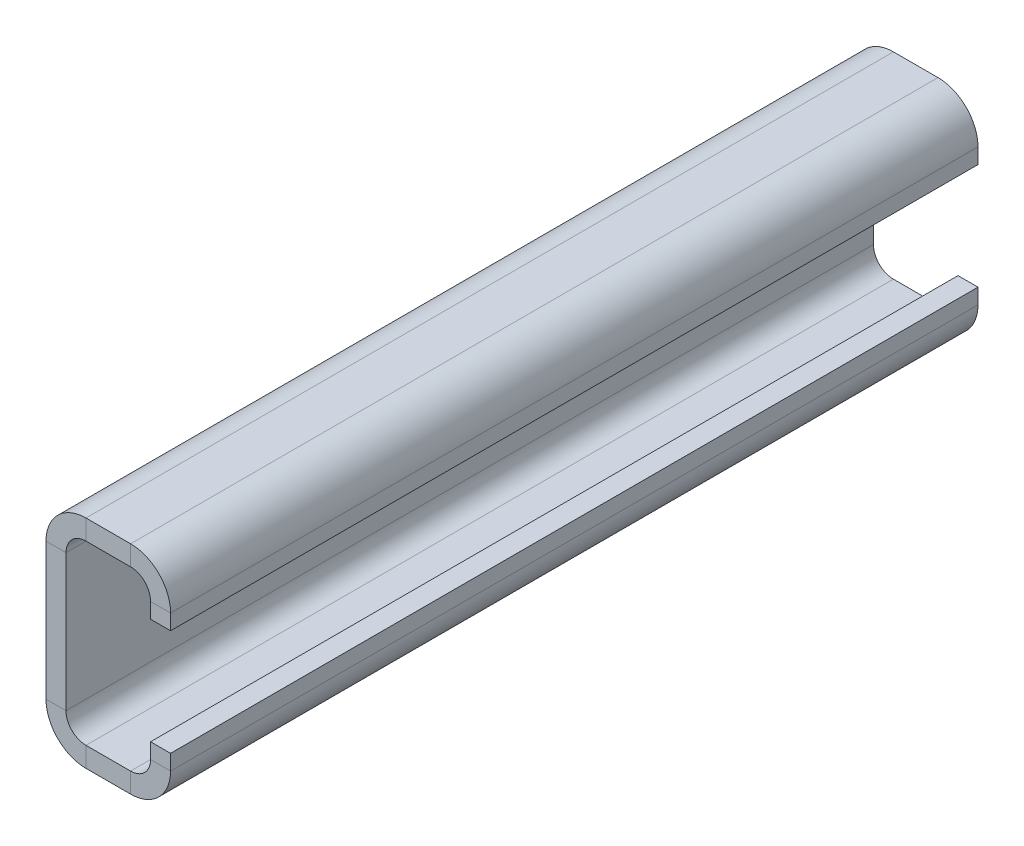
ISO-10303-21;
HEADER;
FILE_DESCRIPTION(('STEP AP214'),'2;1');
FILE_NAME('part.step','',(''),(''),'','','');
FILE_SCHEMA(('AUTOMOTIVE_DESIGN { 1 0 10303 214 1 1 1 1 }'));
ENDSEC;
DATA;
#1=APPLICATION_CONTEXT('core data for automotive mechanical design processes');
#2=APPLICATION_PROTOCOL_DEFINITION('international standard','automotive_design',2000,#1);
#3=PRODUCT_CONTEXT('',#1,'mechanical');
#4=PRODUCT('Part','Part','',(#3));
#5=PRODUCT_RELATED_PRODUCT_CATEGORY('part','',(#4));
#6=PRODUCT_DEFINITION_FORMATION('','',#4);
#7=PRODUCT_DEFINITION_CONTEXT('part definition',#1,'design');
#8=PRODUCT_DEFINITION('design','',#6,#7);
#9=PRODUCT_DEFINITION_SHAPE('','',#8);
#10=(LENGTH_UNIT() NAMED_UNIT(*) SI_UNIT(.MILLI.,.METRE.));
#11=(NAMED_UNIT(*) PLANE_ANGLE_UNIT() SI_UNIT($,.RADIAN.));
#12=(NAMED_UNIT(*) SI_UNIT($,.STERADIAN.) SOLID_ANGLE_UNIT());
#13=UNCERTAINTY_MEASURE_WITH_UNIT(LENGTH_MEASURE(1.E-05),#10,'distance_accuracy_value','');
#14=(GEOMETRIC_REPRESENTATION_CONTEXT(3) GLOBAL_UNCERTAINTY_ASSIGNED_CONTEXT((#13)) GLOBAL_UNIT_ASSIGNED_CONTEXT((#10,
#11,#12)) REPRESENTATION_CONTEXT('',''));
#15=CARTESIAN_POINT('',(0.,0.,0.));
#16=DIRECTION('',(0.,0.,1.));
#17=DIRECTION('',(1.,0.,0.));
#18=AXIS2_PLACEMENT_3D('',#15,#16,#17);
#19=CARTESIAN_POINT('',(11.,-14.100000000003,105.000000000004));
#20=DIRECTION('',(0.,0.,1.00000000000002));
#21=DIRECTION('',(1.,0.,0.));
#22=AXIS2_PLACEMENT_3D('',#19,#20,#21);
#23=PLANE('',#22);
#24=DIRECTION('',(0.,1.00000000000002,0.));
#25=VECTOR('',#24,1.);
#26=CARTESIAN_POINT('',(11.,-14.100000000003,105.000000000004));
#27=LINE('',#26,#25);
#28=CARTESIAN_POINT('',(11.,-14.100000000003,105.000000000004));
#29=VERTEX_POINT('',#28);
#30=CARTESIAN_POINT('',(11.,-11.5000000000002,105.000000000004));
#31=VERTEX_POINT('',#30);
#32=EDGE_CURVE('E11',#29,#31,#27,.T.);
#33=ORIENTED_EDGE('',*,*,#32,.F.);
#34=CARTESIAN_POINT('',(11.,-8.90000000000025,105.000000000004));
#35=DIRECTION('',(0.,0.,1.00000000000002));
#36=DIRECTION('',(1.,0.,0.));
#37=AXIS2_PLACEMENT_3D('',#34,#35,#36);
#38=CIRCLE('',#37,5.2);
#39=CARTESIAN_POINT('',(16.2,-8.90000000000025,105.000000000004));
#40=VERTEX_POINT('',#39);
#41=EDGE_CURVE('E311',#40,#29,#38,.F.);
#42=ORIENTED_EDGE('',*,*,#41,.F.);
#43=DIRECTION('',(1.,0.,0.));
#44=VECTOR('',#43,1.);
#45=CARTESIAN_POINT('',(13.6,-8.90000000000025,105.000000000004));
#46=LINE('',#45,#44);
#47=CARTESIAN_POINT('',(13.6,-8.90000000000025,105.000000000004));
#48=VERTEX_POINT('',#47);
#49=EDGE_CURVE('E48',#48,#40,#46,.T.);
#50=ORIENTED_EDGE('',*,*,#49,.F.);
#51=CARTESIAN_POINT('',(11.,-8.90000000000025,105.000000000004));
#52=DIRECTION('',(0.,0.,1.00000000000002));
#53=DIRECTION('',(1.,0.,0.));
#54=AXIS2_PLACEMENT_3D('',#51,#52,#53);
#55=CIRCLE('',#54,2.6);
#56=EDGE_CURVE('E326',#48,#31,#55,.F.);
#57=ORIENTED_EDGE('',*,*,#56,.T.);
#58=EDGE_LOOP('',(#33,#42,#50,#57));
#59=FACE_BOUND('',#58,.T.);
#60=ADVANCED_FACE('F40',(#59),#23,.T.);
#61=CARTESIAN_POINT('',(13.6,-8.90000000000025,105.000000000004));
#62=DIRECTION('',(0.,0.,1.00000000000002));
#63=DIRECTION('',(1.,0.,0.));
#64=AXIS2_PLACEMENT_3D('',#61,#62,#63);
#65=PLANE('',#64);
#66=DIRECTION('',(-1.,0.,0.));
#67=VECTOR('',#66,1.);
#68=CARTESIAN_POINT('',(16.2,-14.100000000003,105.000000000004));
#69=LINE('',#68,#67);
#70=CARTESIAN_POINT('',(5.19999999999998,-14.100000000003,105.000000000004));
#71=VERTEX_POINT('',#70);
#72=EDGE_CURVE('E307',#29,#71,#69,.T.);
#73=ORIENTED_EDGE('',*,*,#72,.F.);
#74=ORIENTED_EDGE('',*,*,#32,.T.);
#75=DIRECTION('',(-1.,0.,0.));
#76=VECTOR('',#75,1.);
#77=CARTESIAN_POINT('',(16.2,-11.5000000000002,105.000000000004));
#78=LINE('',#77,#76);
#79=CARTESIAN_POINT('',(5.19999999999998,-11.5000000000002,105.000000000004));
#80=VERTEX_POINT('',#79);
#81=EDGE_CURVE('E330',#31,#80,#78,.T.);
#82=ORIENTED_EDGE('',*,*,#81,.T.);
#83=DIRECTION('',(0.,-1.00000000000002,0.));
#84=VECTOR('',#83,1.);
#85=CARTESIAN_POINT('',(5.19999999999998,-11.5000000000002,105.000000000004));
#86=LINE('',#85,#84);
#87=EDGE_CURVE('E448',#80,#71,#86,.T.);
#88=ORIENTED_EDGE('',*,*,#87,.T.);
#89=EDGE_LOOP('',(#73,#74,#82,#88));
#90=FACE_BOUND('',#89,.T.);
#91=ADVANCED_FACE('F495',(#90),#65,.T.);
#92=CARTESIAN_POINT('',(16.2,-8.90000000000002,0.));
#93=DIRECTION('',(0.,0.,-1.00000000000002));
#94=DIRECTION('',(-1.,0.,0.));
#95=AXIS2_PLACEMENT_3D('',#92,#93,#94);
#96=PLANE('',#95);
#97=DIRECTION('',(-1.,0.,0.));
#98=VECTOR('',#97,1.);
#99=CARTESIAN_POINT('',(16.2,-8.90000000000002,0.));
#100=LINE('',#99,#98);
#101=CARTESIAN_POINT('',(16.2,-8.90000000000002,0.));
#102=VERTEX_POINT('',#101);
#103=CARTESIAN_POINT('',(13.6,-8.90000000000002,0.));
#104=VERTEX_POINT('',#103);
#105=EDGE_CURVE('E457',#102,#104,#100,.T.);
#106=ORIENTED_EDGE('',*,*,#105,.F.);
#107=CARTESIAN_POINT('',(11.,-8.90000000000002,0.));
#108=DIRECTION('',(0.,0.,1.00000000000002));
#109=DIRECTION('',(1.,0.,0.));
#110=AXIS2_PLACEMENT_3D('',#107,#108,#109);
#111=CIRCLE('',#110,5.2);
#112=CARTESIAN_POINT('',(11.,-14.100000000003,0.));
#113=VERTEX_POINT('',#112);
#114=EDGE_CURVE('E234',#102,#113,#111,.F.);
#115=ORIENTED_EDGE('',*,*,#114,.T.);
#116=DIRECTION('',(0.,-1.00000000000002,0.));
#117=VECTOR('',#116,1.);
#118=CARTESIAN_POINT('',(11.,-11.5,0.));
#119=LINE('',#118,#117);
#120=CARTESIAN_POINT('',(11.,-11.5,0.));
#121=VERTEX_POINT('',#120);
#122=EDGE_CURVE('E454',#121,#113,#119,.T.);
#123=ORIENTED_EDGE('',*,*,#122,.F.);
#124=CARTESIAN_POINT('',(11.,-8.90000000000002,0.));
#125=DIRECTION('',(0.,0.,1.00000000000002));
#126=DIRECTION('',(1.,0.,0.));
#127=AXIS2_PLACEMENT_3D('',#124,#125,#126);
#128=CIRCLE('',#127,2.6);
#129=EDGE_CURVE('E250',#104,#121,#128,.F.);
#130=ORIENTED_EDGE('',*,*,#129,.F.);
#131=EDGE_LOOP('',(#106,#115,#123,#130));
#132=FACE_BOUND('',#131,.T.);
#133=ADVANCED_FACE('F503',(#132),#96,.T.);
#134=CARTESIAN_POINT('',(11.,-11.5,0.));
#135=DIRECTION('',(0.,0.,-1.00000000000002));
#136=DIRECTION('',(-1.,0.,0.));
#137=AXIS2_PLACEMENT_3D('',#134,#135,#136);
#138=PLANE('',#137);
#139=DIRECTION('',(0.,-1.00000000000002,0.));
#140=VECTOR('',#139,1.);
#141=CARTESIAN_POINT('',(16.2,-6.90000000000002,0.));
#142=LINE('',#141,#140);
#143=CARTESIAN_POINT('',(16.2,-6.90000000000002,0.));
#144=VERTEX_POINT('',#143);
#145=EDGE_CURVE('E238',#144,#102,#142,.T.);
#146=ORIENTED_EDGE('',*,*,#145,.T.);
#147=ORIENTED_EDGE('',*,*,#105,.T.);
#148=DIRECTION('',(0.,1.00000000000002,0.));
#149=VECTOR('',#148,1.);
#150=CARTESIAN_POINT('',(13.6,-6.90000000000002,0.));
#151=LINE('',#150,#149);
#152=CARTESIAN_POINT('',(13.6,-6.90000000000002,0.));
#153=VERTEX_POINT('',#152);
#154=EDGE_CURVE('E246',#153,#104,#151,.F.);
#155=ORIENTED_EDGE('',*,*,#154,.F.);
#156=DIRECTION('',(1.,0.,0.));
#157=VECTOR('',#156,1.);
#158=CARTESIAN_POINT('',(13.6,-6.90000000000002,0.));
#159=LINE('',#158,#157);
#160=EDGE_CURVE('E242',#153,#144,#159,.T.);
#161=ORIENTED_EDGE('',*,*,#160,.T.);
#162=EDGE_LOOP('',(#146,#147,#155,#161));
#163=FACE_BOUND('',#162,.T.);
#164=ADVANCED_FACE('F505',(#163),#138,.T.);
#165=CARTESIAN_POINT('',(0.,-8.90000000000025,105.000000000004));
#166=DIRECTION('',(0.,0.,1.00000000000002));
#167=DIRECTION('',(1.,0.,0.));
#168=AXIS2_PLACEMENT_3D('',#165,#166,#167);
#169=PLANE('',#168);
#170=DIRECTION('',(1.,0.,0.));
#171=VECTOR('',#170,1.);
#172=CARTESIAN_POINT('',(0.,-8.90000000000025,105.000000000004));
#173=LINE('',#172,#171);
#174=CARTESIAN_POINT('',(0.,-8.90000000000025,105.000000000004));
#175=VERTEX_POINT('',#174);
#176=CARTESIAN_POINT('',(2.59999999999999,-8.90000000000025,105.000000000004));
#177=VERTEX_POINT('',#176);
#178=EDGE_CURVE('E451',#175,#177,#173,.T.);
#179=ORIENTED_EDGE('',*,*,#178,.F.);
#180=CARTESIAN_POINT('',(5.19999999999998,-8.90000000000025,105.000000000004));
#181=DIRECTION('',(0.,0.,1.00000000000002));
#182=DIRECTION('',(1.,0.,0.));
#183=AXIS2_PLACEMENT_3D('',#180,#181,#182);
#184=CIRCLE('',#183,5.2);
#185=EDGE_CURVE('E303',#71,#175,#184,.F.);
#186=ORIENTED_EDGE('',*,*,#185,.F.);
#187=ORIENTED_EDGE('',*,*,#87,.F.);
#188=CARTESIAN_POINT('',(5.19999999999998,-8.90000000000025,105.000000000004));
#189=DIRECTION('',(0.,0.,1.00000000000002));
#190=DIRECTION('',(1.,0.,0.));
#191=AXIS2_PLACEMENT_3D('',#188,#189,#190);
#192=CIRCLE('',#191,2.6);
#193=EDGE_CURVE('E334',#80,#177,#192,.F.);
#194=ORIENTED_EDGE('',*,*,#193,.T.);
#195=EDGE_LOOP('',(#179,#186,#187,#194));
#196=FACE_BOUND('',#195,.T.);
#197=ADVANCED_FACE('F507',(#196),#169,.T.);
#198=CARTESIAN_POINT('',(5.19999999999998,-11.5000000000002,105.000000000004));
#199=DIRECTION('',(0.,0.,1.00000000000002));
#200=DIRECTION('',(1.,0.,0.));
#201=AXIS2_PLACEMENT_3D('',#198,#199,#200);
#202=PLANE('',#201);
#203=DIRECTION('',(0.,1.00000000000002,0.));
#204=VECTOR('',#203,1.);
#205=CARTESIAN_POINT('',(0.,-14.100000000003,105.000000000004));
#206=LINE('',#205,#204);
#207=CARTESIAN_POINT('',(0.,8.89999999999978,105.000000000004));
#208=VERTEX_POINT('',#207);
#209=EDGE_CURVE('E299',#175,#208,#206,.T.);
#210=ORIENTED_EDGE('',*,*,#209,.F.);
#211=ORIENTED_EDGE('',*,*,#178,.T.);
#212=DIRECTION('',(0.,1.00000000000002,0.));
#213=VECTOR('',#212,1.);
#214=CARTESIAN_POINT('',(2.59999999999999,-14.100000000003,105.000000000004));
#215=LINE('',#214,#213);
#216=CARTESIAN_POINT('',(2.59999999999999,8.89999999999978,105.000000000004));
#217=VERTEX_POINT('',#216);
#218=EDGE_CURVE('E338',#177,#217,#215,.T.);
#219=ORIENTED_EDGE('',*,*,#218,.T.);
#220=DIRECTION('',(-1.,0.,0.));
#221=VECTOR('',#220,1.);
#222=CARTESIAN_POINT('',(2.59999999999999,8.89999999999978,105.000000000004));
#223=LINE('',#222,#221);
#224=EDGE_CURVE('E436',#217,#208,#223,.T.);
#225=ORIENTED_EDGE('',*,*,#224,.T.);
#226=EDGE_LOOP('',(#210,#211,#219,#225));
#227=FACE_BOUND('',#226,.T.);
#228=ADVANCED_FACE('F513',(#227),#202,.T.);
#229=CARTESIAN_POINT('',(5.19999999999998,-14.100000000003,0.));
#230=DIRECTION('',(0.,0.,-1.00000000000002));
#231=DIRECTION('',(-1.,0.,0.));
#232=AXIS2_PLACEMENT_3D('',#229,#230,#231);
#233=PLANE('',#232);
#234=DIRECTION('',(0.,1.00000000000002,0.));
#235=VECTOR('',#234,1.);
#236=CARTESIAN_POINT('',(5.19999999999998,-14.100000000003,0.));
#237=LINE('',#236,#235);
#238=CARTESIAN_POINT('',(5.19999999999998,-14.100000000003,0.));
#239=VERTEX_POINT('',#238);
#240=CARTESIAN_POINT('',(5.19999999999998,-11.5,0.));
#241=VERTEX_POINT('',#240);
#242=EDGE_CURVE('E445',#239,#241,#237,.T.);
#243=ORIENTED_EDGE('',*,*,#242,.F.);
#244=CARTESIAN_POINT('',(5.19999999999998,-8.90000000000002,0.));
#245=DIRECTION('',(0.,0.,1.00000000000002));
#246=DIRECTION('',(1.,0.,0.));
#247=AXIS2_PLACEMENT_3D('',#244,#245,#246);
#248=CIRCLE('',#247,5.2);
#249=CARTESIAN_POINT('',(0.,-8.90000000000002,0.));
#250=VERTEX_POINT('',#249);
#251=EDGE_CURVE('E226',#239,#250,#248,.F.);
#252=ORIENTED_EDGE('',*,*,#251,.T.);
#253=DIRECTION('',(-1.,0.,0.));
#254=VECTOR('',#253,1.);
#255=CARTESIAN_POINT('',(2.59999999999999,-8.90000000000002,0.));
#256=LINE('',#255,#254);
#257=CARTESIAN_POINT('',(2.59999999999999,-8.90000000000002,0.));
#258=VERTEX_POINT('',#257);
#259=EDGE_CURVE('E442',#258,#250,#256,.T.);
#260=ORIENTED_EDGE('',*,*,#259,.F.);
#261=CARTESIAN_POINT('',(5.19999999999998,-8.90000000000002,0.));
#262=DIRECTION('',(0.,0.,1.00000000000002));
#263=DIRECTION('',(1.,0.,0.));
#264=AXIS2_PLACEMENT_3D('',#261,#262,#263);
#265=CIRCLE('',#264,2.6);
#266=EDGE_CURVE('E258',#241,#258,#265,.F.);
#267=ORIENTED_EDGE('',*,*,#266,.F.);
#268=EDGE_LOOP('',(#243,#252,#260,#267));
#269=FACE_BOUND('',#268,.T.);
#270=ADVANCED_FACE('F543',(#269),#233,.T.);
#271=CARTESIAN_POINT('',(2.59999999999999,-8.90000000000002,0.));
#272=DIRECTION('',(0.,0.,-1.00000000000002));
#273=DIRECTION('',(-1.,0.,0.));
#274=AXIS2_PLACEMENT_3D('',#271,#272,#273);
#275=PLANE('',#274);
#276=DIRECTION('',(-1.,0.,0.));
#277=VECTOR('',#276,1.);
#278=CARTESIAN_POINT('',(16.2,-14.100000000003,0.));
#279=LINE('',#278,#277);
#280=EDGE_CURVE('E230',#113,#239,#279,.T.);
#281=ORIENTED_EDGE('',*,*,#280,.T.);
#282=ORIENTED_EDGE('',*,*,#242,.T.);
#283=DIRECTION('',(-1.,0.,0.));
#284=VECTOR('',#283,1.);
#285=CARTESIAN_POINT('',(16.2,-11.5,0.));
#286=LINE('',#285,#284);
#287=EDGE_CURVE('E254',#121,#241,#286,.T.);
#288=ORIENTED_EDGE('',*,*,#287,.F.);
#289=ORIENTED_EDGE('',*,*,#122,.T.);
#290=EDGE_LOOP('',(#281,#282,#288,#289));
#291=FACE_BOUND('',#290,.T.);
#292=ADVANCED_FACE('F552',(#291),#275,.T.);
#293=CARTESIAN_POINT('',(5.19999999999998,14.0999999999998,105.000000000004));
#294=DIRECTION('',(0.,0.,1.00000000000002));
#295=DIRECTION('',(1.,0.,0.));
#296=AXIS2_PLACEMENT_3D('',#293,#294,#295);
#297=PLANE('',#296);
#298=DIRECTION('',(0.,-1.00000000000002,0.));
#299=VECTOR('',#298,1.);
#300=CARTESIAN_POINT('',(5.19999999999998,14.0999999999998,105.000000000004));
#301=LINE('',#300,#299);
#302=CARTESIAN_POINT('',(5.19999999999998,14.0999999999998,105.000000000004));
#303=VERTEX_POINT('',#302);
#304=CARTESIAN_POINT('',(5.19999999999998,11.4999999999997,105.000000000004));
#305=VERTEX_POINT('',#304);
#306=EDGE_CURVE('E439',#303,#305,#301,.T.);
#307=ORIENTED_EDGE('',*,*,#306,.F.);
#308=CARTESIAN_POINT('',(5.19999999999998,8.89999999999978,105.000000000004));
#309=DIRECTION('',(0.,0.,1.00000000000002));
#310=DIRECTION('',(1.,0.,0.));
#311=AXIS2_PLACEMENT_3D('',#308,#309,#310);
#312=CIRCLE('',#311,5.2);
#313=EDGE_CURVE('E295',#208,#303,#312,.F.);
#314=ORIENTED_EDGE('',*,*,#313,.F.);
#315=ORIENTED_EDGE('',*,*,#224,.F.);
#316=CARTESIAN_POINT('',(5.19999999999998,8.89999999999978,105.000000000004));
#317=DIRECTION('',(0.,0.,1.00000000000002));
#318=DIRECTION('',(1.,0.,0.));
#319=AXIS2_PLACEMENT_3D('',#316,#317,#318);
#320=CIRCLE('',#319,2.6);
#321=EDGE_CURVE('E341',#217,#305,#320,.F.);
#322=ORIENTED_EDGE('',*,*,#321,.T.);
#323=EDGE_LOOP('',(#307,#314,#315,#322));
#324=FACE_BOUND('',#323,.T.);
#325=ADVANCED_FACE('F561',(#324),#297,.T.);
#326=CARTESIAN_POINT('',(2.59999999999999,8.89999999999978,105.000000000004));
#327=DIRECTION('',(0.,0.,1.00000000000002));
#328=DIRECTION('',(1.,0.,0.));
#329=AXIS2_PLACEMENT_3D('',#326,#327,#328);
#330=PLANE('',#329);
#331=DIRECTION('',(1.,0.,0.));
#332=VECTOR('',#331,1.);
#333=CARTESIAN_POINT('',(0.,14.0999999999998,105.000000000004));
#334=LINE('',#333,#332);
#335=CARTESIAN_POINT('',(11.,14.0999999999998,105.000000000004));
#336=VERTEX_POINT('',#335);
#337=EDGE_CURVE('E291',#303,#336,#334,.T.);
#338=ORIENTED_EDGE('',*,*,#337,.F.);
#339=ORIENTED_EDGE('',*,*,#306,.T.);
#340=DIRECTION('',(1.,0.,0.));
#341=VECTOR('',#340,1.);
#342=CARTESIAN_POINT('',(0.,11.4999999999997,105.000000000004));
#343=LINE('',#342,#341);
#344=CARTESIAN_POINT('',(11.,11.4999999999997,105.000000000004));
#345=VERTEX_POINT('',#344);
#346=EDGE_CURVE('E345',#305,#345,#343,.T.);
#347=ORIENTED_EDGE('',*,*,#346,.T.);
#348=DIRECTION('',(0.,1.00000000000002,0.));
#349=VECTOR('',#348,1.);
#350=CARTESIAN_POINT('',(11.,11.4999999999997,105.000000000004));
#351=LINE('',#350,#349);
#352=EDGE_CURVE('E62',#345,#336,#351,.T.);
#353=ORIENTED_EDGE('',*,*,#352,.T.);
#354=EDGE_LOOP('',(#338,#339,#347,#353));
#355=FACE_BOUND('',#354,.T.);
#356=ADVANCED_FACE('F569',(#355),#330,.T.);
#357=CARTESIAN_POINT('',(0.,8.90000000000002,0.));
#358=DIRECTION('',(0.,0.,-1.00000000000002));
#359=DIRECTION('',(-1.,0.,0.));
#360=AXIS2_PLACEMENT_3D('',#357,#358,#359);
#361=PLANE('',#360);
#362=DIRECTION('',(1.,0.,0.));
#363=VECTOR('',#362,1.);
#364=CARTESIAN_POINT('',(0.,8.90000000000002,0.));
#365=LINE('',#364,#363);
#366=CARTESIAN_POINT('',(0.,8.90000000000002,0.));
#367=VERTEX_POINT('',#366);
#368=CARTESIAN_POINT('',(2.59999999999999,8.90000000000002,0.));
#369=VERTEX_POINT('',#368);
#370=EDGE_CURVE('E433',#367,#369,#365,.T.);
#371=ORIENTED_EDGE('',*,*,#370,.F.);
#372=CARTESIAN_POINT('',(5.19999999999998,8.90000000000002,0.));
#373=DIRECTION('',(0.,0.,1.00000000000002));
#374=DIRECTION('',(1.,0.,0.));
#375=AXIS2_PLACEMENT_3D('',#372,#373,#374);
#376=CIRCLE('',#375,5.2);
#377=CARTESIAN_POINT('',(5.19999999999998,14.1,0.));
#378=VERTEX_POINT('',#377);
#379=EDGE_CURVE('E218',#367,#378,#376,.F.);
#380=ORIENTED_EDGE('',*,*,#379,.T.);
#381=DIRECTION('',(0.,1.00000000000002,0.));
#382=VECTOR('',#381,1.);
#383=CARTESIAN_POINT('',(5.19999999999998,11.5,0.));
#384=LINE('',#383,#382);
#385=CARTESIAN_POINT('',(5.19999999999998,11.5,0.));
#386=VERTEX_POINT('',#385);
#387=EDGE_CURVE('E430',#386,#378,#384,.T.);
#388=ORIENTED_EDGE('',*,*,#387,.F.);
#389=CARTESIAN_POINT('',(5.19999999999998,8.90000000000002,0.));
#390=DIRECTION('',(0.,0.,1.00000000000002));
#391=DIRECTION('',(1.,0.,0.));
#392=AXIS2_PLACEMENT_3D('',#389,#390,#391);
#393=CIRCLE('',#392,2.6);
#394=EDGE_CURVE('E266',#369,#386,#393,.F.);
#395=ORIENTED_EDGE('',*,*,#394,.F.);
#396=EDGE_LOOP('',(#371,#380,#388,#395));
#397=FACE_BOUND('',#396,.T.);
#398=ADVANCED_FACE('F578',(#397),#361,.T.);
#399=CARTESIAN_POINT('',(5.19999999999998,11.5,0.));
#400=DIRECTION('',(0.,0.,-1.00000000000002));
#401=DIRECTION('',(-1.,0.,0.));
#402=AXIS2_PLACEMENT_3D('',#399,#400,#401);
#403=PLANE('',#402);
#404=DIRECTION('',(0.,1.00000000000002,0.));
#405=VECTOR('',#404,1.);
#406=CARTESIAN_POINT('',(0.,-14.100000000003,0.));
#407=LINE('',#406,#405);
#408=EDGE_CURVE('E222',#250,#367,#407,.T.);
#409=ORIENTED_EDGE('',*,*,#408,.T.);
#410=ORIENTED_EDGE('',*,*,#370,.T.);
#411=DIRECTION('',(0.,1.00000000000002,0.));
#412=VECTOR('',#411,1.);
#413=CARTESIAN_POINT('',(2.59999999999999,-14.100000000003,0.));
#414=LINE('',#413,#412);
#415=EDGE_CURVE('E262',#258,#369,#414,.T.);
#416=ORIENTED_EDGE('',*,*,#415,.F.);
#417=ORIENTED_EDGE('',*,*,#259,.T.);
#418=EDGE_LOOP('',(#409,#410,#416,#417));
#419=FACE_BOUND('',#418,.T.);
#420=ADVANCED_FACE('F587',(#419),#403,.T.);
#421=CARTESIAN_POINT('',(16.2,8.89999999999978,105.000000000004));
#422=DIRECTION('',(0.,0.,1.00000000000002));
#423=DIRECTION('',(1.,0.,0.));
#424=AXIS2_PLACEMENT_3D('',#421,#422,#423);
#425=PLANE('',#424);
#426=DIRECTION('',(-1.,0.,0.));
#427=VECTOR('',#426,1.);
#428=CARTESIAN_POINT('',(16.2,8.89999999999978,105.000000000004));
#429=LINE('',#428,#427);
#430=CARTESIAN_POINT('',(16.2,8.89999999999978,105.000000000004));
#431=VERTEX_POINT('',#430);
#432=CARTESIAN_POINT('',(13.6,8.89999999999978,105.000000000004));
#433=VERTEX_POINT('',#432);
#434=EDGE_CURVE('E55',#431,#433,#429,.T.);
#435=ORIENTED_EDGE('',*,*,#434,.F.);
#436=CARTESIAN_POINT('',(11.,8.89999999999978,105.000000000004));
#437=DIRECTION('',(0.,0.,1.00000000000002));
#438=DIRECTION('',(1.,0.,0.));
#439=AXIS2_PLACEMENT_3D('',#436,#437,#438);
#440=CIRCLE('',#439,5.2);
#441=EDGE_CURVE('E287',#336,#431,#440,.F.);
#442=ORIENTED_EDGE('',*,*,#441,.F.);
#443=ORIENTED_EDGE('',*,*,#352,.F.);
#444=CARTESIAN_POINT('',(11.,8.89999999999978,105.000000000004));
#445=DIRECTION('',(0.,0.,1.00000000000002));
#446=DIRECTION('',(1.,0.,0.));
#447=AXIS2_PLACEMENT_3D('',#444,#445,#446);
#448=CIRCLE('',#447,2.6);
#449=EDGE_CURVE('E348',#345,#433,#448,.F.);
#450=ORIENTED_EDGE('',*,*,#449,.T.);
#451=EDGE_LOOP('',(#435,#442,#443,#450));
#452=FACE_BOUND('',#451,.T.);
#453=ADVANCED_FACE('F596',(#452),#425,.T.);
#454=CARTESIAN_POINT('',(11.,11.4999999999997,105.000000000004));
#455=DIRECTION('',(0.,0.,1.00000000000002));
#456=DIRECTION('',(1.,0.,0.));
#457=AXIS2_PLACEMENT_3D('',#454,#455,#456);
#458=PLANE('',#457);
#459=DIRECTION('',(0.,-1.00000000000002,0.));
#460=VECTOR('',#459,1.);
#461=CARTESIAN_POINT('',(16.2,14.0999999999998,105.000000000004));
#462=LINE('',#461,#460);
#463=CARTESIAN_POINT('',(16.2,6.89999999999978,105.000000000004));
#464=VERTEX_POINT('',#463);
#465=EDGE_CURVE('E283',#431,#464,#462,.T.);
#466=ORIENTED_EDGE('',*,*,#465,.F.);
#467=ORIENTED_EDGE('',*,*,#434,.T.);
#468=DIRECTION('',(0.,1.00000000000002,0.));
#469=VECTOR('',#468,1.);
#470=CARTESIAN_POINT('',(13.6,14.0999999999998,105.000000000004));
#471=LINE('',#470,#469);
#472=CARTESIAN_POINT('',(13.6,6.89999999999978,105.000000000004));
#473=VERTEX_POINT('',#472);
#474=EDGE_CURVE('E278',#433,#473,#471,.F.);
#475=ORIENTED_EDGE('',*,*,#474,.T.);
#476=DIRECTION('',(-1.,0.,0.));
#477=VECTOR('',#476,1.);
#478=CARTESIAN_POINT('',(16.2,6.89999999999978,105.000000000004));
#479=LINE('',#478,#477);
#480=EDGE_CURVE('E184',#464,#473,#479,.T.);
#481=ORIENTED_EDGE('',*,*,#480,.F.);
#482=EDGE_LOOP('',(#466,#467,#475,#481));
#483=FACE_BOUND('',#482,.T.);
#484=ADVANCED_FACE('F605',(#483),#458,.T.);
#485=CARTESIAN_POINT('',(11.,14.1,0.));
#486=DIRECTION('',(0.,0.,-1.00000000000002));
#487=DIRECTION('',(-1.,0.,0.));
#488=AXIS2_PLACEMENT_3D('',#485,#486,#487);
#489=PLANE('',#488);
#490=DIRECTION('',(0.,-1.00000000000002,0.));
#491=VECTOR('',#490,1.);
#492=CARTESIAN_POINT('',(11.,14.1,0.));
#493=LINE('',#492,#491);
#494=CARTESIAN_POINT('',(11.,14.1,0.));
#495=VERTEX_POINT('',#494);
#496=CARTESIAN_POINT('',(11.,11.5,0.));
#497=VERTEX_POINT('',#496);
#498=EDGE_CURVE('E423',#495,#497,#493,.T.);
#499=ORIENTED_EDGE('',*,*,#498,.F.);
#500=CARTESIAN_POINT('',(11.,8.90000000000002,0.));
#501=DIRECTION('',(0.,0.,1.00000000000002));
#502=DIRECTION('',(1.,0.,0.));
#503=AXIS2_PLACEMENT_3D('',#500,#501,#502);
#504=CIRCLE('',#503,5.2);
#505=CARTESIAN_POINT('',(16.2,8.90000000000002,0.));
#506=VERTEX_POINT('',#505);
#507=EDGE_CURVE('E208',#495,#506,#504,.F.);
#508=ORIENTED_EDGE('',*,*,#507,.T.);
#509=DIRECTION('',(1.,0.,0.));
#510=VECTOR('',#509,1.);
#511=CARTESIAN_POINT('',(13.6,8.90000000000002,0.));
#512=LINE('',#511,#510);
#513=CARTESIAN_POINT('',(13.6,8.90000000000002,0.));
#514=VERTEX_POINT('',#513);
#515=EDGE_CURVE('E188',#514,#506,#512,.T.);
#516=ORIENTED_EDGE('',*,*,#515,.F.);
#517=CARTESIAN_POINT('',(11.,8.90000000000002,0.));
#518=DIRECTION('',(0.,0.,1.00000000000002));
#519=DIRECTION('',(1.,0.,0.));
#520=AXIS2_PLACEMENT_3D('',#517,#518,#519);
#521=CIRCLE('',#520,2.6);
#522=EDGE_CURVE('E274',#497,#514,#521,.F.);
#523=ORIENTED_EDGE('',*,*,#522,.F.);
#524=EDGE_LOOP('',(#499,#508,#516,#523));
#525=FACE_BOUND('',#524,.T.);
#526=ADVANCED_FACE('F613',(#525),#489,.T.);
#527=CARTESIAN_POINT('',(13.6,8.90000000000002,0.));
#528=DIRECTION('',(0.,0.,-1.00000000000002));
#529=DIRECTION('',(-1.,0.,0.));
#530=AXIS2_PLACEMENT_3D('',#527,#528,#529);
#531=PLANE('',#530);
#532=DIRECTION('',(1.,0.,0.));
#533=VECTOR('',#532,1.);
#534=CARTESIAN_POINT('',(0.,14.1,0.));
#535=LINE('',#534,#533);
#536=EDGE_CURVE('E214',#378,#495,#535,.T.);
#537=ORIENTED_EDGE('',*,*,#536,.T.);
#538=ORIENTED_EDGE('',*,*,#498,.T.);
#539=DIRECTION('',(1.,0.,0.));
#540=VECTOR('',#539,1.);
#541=CARTESIAN_POINT('',(0.,11.5,0.));
#542=LINE('',#541,#540);
#543=EDGE_CURVE('E270',#386,#497,#542,.T.);
#544=ORIENTED_EDGE('',*,*,#543,.F.);
#545=ORIENTED_EDGE('',*,*,#387,.T.);
#546=EDGE_LOOP('',(#537,#538,#544,#545));
#547=FACE_BOUND('',#546,.T.);
#548=ADVANCED_FACE('F621',(#547),#531,.T.);
#549=CARTESIAN_POINT('',(13.6,14.0999999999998,105.000000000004));
#550=DIRECTION('',(1.,0.,0.));
#551=DIRECTION('',(0.,0.,-1.00000000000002));
#552=AXIS2_PLACEMENT_3D('',#549,#550,#551);
#553=PLANE('',#552);
#554=DIRECTION('',(0.,1.00000000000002,0.));
#555=VECTOR('',#554,1.);
#556=CARTESIAN_POINT('',(13.6,14.1,0.));
#557=LINE('',#556,#555);
#558=CARTESIAN_POINT('',(13.6,6.90000000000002,0.));
#559=VERTEX_POINT('',#558);
#560=EDGE_CURVE('E193',#514,#559,#557,.F.);
#561=ORIENTED_EDGE('',*,*,#560,.T.);
#562=DIRECTION('',(0.,0.,-1.00000000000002));
#563=VECTOR('',#562,1.);
#564=CARTESIAN_POINT('',(13.6,6.89999999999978,105.000000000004));
#565=LINE('',#564,#563);
#566=EDGE_CURVE('E177',#473,#559,#565,.T.);
#567=ORIENTED_EDGE('',*,*,#566,.F.);
#568=ORIENTED_EDGE('',*,*,#474,.F.);
#569=DIRECTION('',(0.,0.,-1.00000000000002));
#570=VECTOR('',#569,1.);
#571=CARTESIAN_POINT('',(13.6,8.89999999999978,105.000000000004));
#572=LINE('',#571,#570);
#573=EDGE_CURVE('E196',#433,#514,#572,.T.);
#574=ORIENTED_EDGE('',*,*,#573,.T.);
#575=EDGE_LOOP('',(#561,#567,#568,#574));
#576=FACE_BOUND('',#575,.T.);
#577=ADVANCED_FACE('F194',(#576),#553,.F.);
#578=CARTESIAN_POINT('',(16.2,6.89999999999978,105.000000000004));
#579=DIRECTION('',(0.,-1.00000000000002,0.));
#580=DIRECTION('',(0.,0.,-1.00000000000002));
#581=AXIS2_PLACEMENT_3D('',#578,#579,#580);
#582=PLANE('',#581);
#583=DIRECTION('',(-1.,0.,0.));
#584=VECTOR('',#583,1.);
#585=CARTESIAN_POINT('',(16.2,6.90000000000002,0.));
#586=LINE('',#585,#584);
#587=CARTESIAN_POINT('',(16.2,6.90000000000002,0.));
#588=VERTEX_POINT('',#587);
#589=EDGE_CURVE('E181',#588,#559,#586,.T.);
#590=ORIENTED_EDGE('',*,*,#589,.F.);
#591=DIRECTION('',(0.,0.,-1.00000000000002));
#592=VECTOR('',#591,1.);
#593=CARTESIAN_POINT('',(16.2,6.89999999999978,105.000000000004));
#594=LINE('',#593,#592);
#595=EDGE_CURVE('E189',#464,#588,#594,.T.);
#596=ORIENTED_EDGE('',*,*,#595,.F.);
#597=ORIENTED_EDGE('',*,*,#480,.T.);
#598=ORIENTED_EDGE('',*,*,#566,.T.);
#599=EDGE_LOOP('',(#590,#596,#597,#598));
#600=FACE_BOUND('',#599,.T.);
#601=ADVANCED_FACE('F179',(#600),#582,.T.);
#602=CARTESIAN_POINT('',(16.2,14.0999999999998,105.000000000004));
#603=DIRECTION('',(1.,0.,0.));
#604=DIRECTION('',(0.,0.,-1.00000000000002));
#605=AXIS2_PLACEMENT_3D('',#602,#603,#604);
#606=PLANE('',#605);
#607=DIRECTION('',(0.,-1.00000000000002,0.));
#608=VECTOR('',#607,1.);
#609=CARTESIAN_POINT('',(16.2,14.1,0.));
#610=LINE('',#609,#608);
#611=EDGE_CURVE('E202',#506,#588,#610,.T.);
#612=ORIENTED_EDGE('',*,*,#611,.F.);
#613=DIRECTION('',(0.,0.,-1.00000000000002));
#614=VECTOR('',#613,1.);
#615=CARTESIAN_POINT('',(16.2,8.89999999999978,105.000000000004));
#616=LINE('',#615,#614);
#617=EDGE_CURVE('E415',#431,#506,#616,.T.);
#618=ORIENTED_EDGE('',*,*,#617,.F.);
#619=ORIENTED_EDGE('',*,*,#465,.T.);
#620=ORIENTED_EDGE('',*,*,#595,.T.);
#621=EDGE_LOOP('',(#612,#618,#619,#620));
#622=FACE_BOUND('',#621,.T.);
#623=ADVANCED_FACE('F645',(#622),#606,.T.);
#624=CARTESIAN_POINT('',(11.,8.89999999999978,105.000000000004));
#625=DIRECTION('',(0.,0.,-1.00000000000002));
#626=DIRECTION('',(-1.,0.,0.));
#627=AXIS2_PLACEMENT_3D('',#624,#625,#626);
#628=CYLINDRICAL_SURFACE('',#627,5.2);
#629=ORIENTED_EDGE('',*,*,#507,.F.);
#630=DIRECTION('',(0.,0.,-1.00000000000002));
#631=VECTOR('',#630,1.);
#632=CARTESIAN_POINT('',(11.,14.0999999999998,105.000000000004));
#633=LINE('',#632,#631);
#634=EDGE_CURVE('E411',#336,#495,#633,.T.);
#635=ORIENTED_EDGE('',*,*,#634,.F.);
#636=ORIENTED_EDGE('',*,*,#441,.T.);
#637=ORIENTED_EDGE('',*,*,#617,.T.);
#638=EDGE_LOOP('',(#629,#635,#636,#637));
#639=FACE_BOUND('',#638,.T.);
#640=ADVANCED_FACE('F653',(#639),#628,.T.);
#641=CARTESIAN_POINT('',(0.,14.0999999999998,105.000000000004));
#642=DIRECTION('',(0.,1.00000000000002,0.));
#643=DIRECTION('',(-1.,0.,0.));
#644=AXIS2_PLACEMENT_3D('',#641,#642,#643);
#645=PLANE('',#644);
#646=ORIENTED_EDGE('',*,*,#536,.F.);
#647=DIRECTION('',(0.,0.,-1.00000000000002));
#648=VECTOR('',#647,1.);
#649=CARTESIAN_POINT('',(5.19999999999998,14.0999999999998,105.000000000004));
#650=LINE('',#649,#648);
#651=EDGE_CURVE('E407',#303,#378,#650,.T.);
#652=ORIENTED_EDGE('',*,*,#651,.F.);
#653=ORIENTED_EDGE('',*,*,#337,.T.);
#654=ORIENTED_EDGE('',*,*,#634,.T.);
#655=EDGE_LOOP('',(#646,#652,#653,#654));
#656=FACE_BOUND('',#655,.T.);
#657=ADVANCED_FACE('F662',(#656),#645,.T.);
#658=CARTESIAN_POINT('',(5.19999999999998,8.89999999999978,105.000000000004));
#659=DIRECTION('',(0.,0.,-1.00000000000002));
#660=DIRECTION('',(-1.,0.,0.));
#661=AXIS2_PLACEMENT_3D('',#658,#659,#660);
#662=CYLINDRICAL_SURFACE('',#661,5.2);
#663=ORIENTED_EDGE('',*,*,#379,.F.);
#664=DIRECTION('',(0.,0.,-1.00000000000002));
#665=VECTOR('',#664,1.);
#666=CARTESIAN_POINT('',(0.,8.89999999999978,105.000000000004));
#667=LINE('',#666,#665);
#668=EDGE_CURVE('E403',#208,#367,#667,.T.);
#669=ORIENTED_EDGE('',*,*,#668,.F.);
#670=ORIENTED_EDGE('',*,*,#313,.T.);
#671=ORIENTED_EDGE('',*,*,#651,.T.);
#672=EDGE_LOOP('',(#663,#669,#670,#671));
#673=FACE_BOUND('',#672,.T.);
#674=ADVANCED_FACE('F671',(#673),#662,.T.);
#675=CARTESIAN_POINT('',(0.,-14.100000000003,105.000000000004));
#676=DIRECTION('',(-1.,0.,0.));
#677=DIRECTION('',(0.,0.,1.00000000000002));
#678=AXIS2_PLACEMENT_3D('',#675,#676,#677);
#679=PLANE('',#678);
#680=ORIENTED_EDGE('',*,*,#408,.F.);
#681=DIRECTION('',(0.,0.,-1.00000000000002));
#682=VECTOR('',#681,1.);
#683=CARTESIAN_POINT('',(0.,-8.90000000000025,105.000000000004));
#684=LINE('',#683,#682);
#685=EDGE_CURVE('E399',#175,#250,#684,.T.);
#686=ORIENTED_EDGE('',*,*,#685,.F.);
#687=ORIENTED_EDGE('',*,*,#209,.T.);
#688=ORIENTED_EDGE('',*,*,#668,.T.);
#689=EDGE_LOOP('',(#680,#686,#687,#688));
#690=FACE_BOUND('',#689,.T.);
#691=ADVANCED_FACE('F680',(#690),#679,.T.);
#692=CARTESIAN_POINT('',(5.19999999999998,-8.90000000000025,105.000000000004));
#693=DIRECTION('',(0.,0.,-1.00000000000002));
#694=DIRECTION('',(-1.,0.,0.));
#695=AXIS2_PLACEMENT_3D('',#692,#693,#694);
#696=CYLINDRICAL_SURFACE('',#695,5.2);
#697=ORIENTED_EDGE('',*,*,#251,.F.);
#698=DIRECTION('',(0.,0.,-1.00000000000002));
#699=VECTOR('',#698,1.);
#700=CARTESIAN_POINT('',(5.19999999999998,-14.100000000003,105.000000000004));
#701=LINE('',#700,#699);
#702=EDGE_CURVE('E395',#71,#239,#701,.T.);
#703=ORIENTED_EDGE('',*,*,#702,.F.);
#704=ORIENTED_EDGE('',*,*,#185,.T.);
#705=ORIENTED_EDGE('',*,*,#685,.T.);
#706=EDGE_LOOP('',(#697,#703,#704,#705));
#707=FACE_BOUND('',#706,.T.);
#708=ADVANCED_FACE('F689',(#707),#696,.T.);
#709=CARTESIAN_POINT('',(16.2,-14.100000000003,105.000000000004));
#710=DIRECTION('',(0.,-1.00000000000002,0.));
#711=DIRECTION('',(1.,0.,0.));
#712=AXIS2_PLACEMENT_3D('',#709,#710,#711);
#713=PLANE('',#712);
#714=ORIENTED_EDGE('',*,*,#280,.F.);
#715=DIRECTION('',(0.,0.,-1.00000000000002));
#716=VECTOR('',#715,1.);
#717=CARTESIAN_POINT('',(11.,-14.100000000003,105.000000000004));
#718=LINE('',#717,#716);
#719=EDGE_CURVE('E391',#29,#113,#718,.T.);
#720=ORIENTED_EDGE('',*,*,#719,.F.);
#721=ORIENTED_EDGE('',*,*,#72,.T.);
#722=ORIENTED_EDGE('',*,*,#702,.T.);
#723=EDGE_LOOP('',(#714,#720,#721,#722));
#724=FACE_BOUND('',#723,.T.);
#725=ADVANCED_FACE('F499',(#724),#713,.T.);
#726=CARTESIAN_POINT('',(11.,-8.90000000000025,105.000000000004));
#727=DIRECTION('',(0.,0.,-1.00000000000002));
#728=DIRECTION('',(-1.,0.,0.));
#729=AXIS2_PLACEMENT_3D('',#726,#727,#728);
#730=CYLINDRICAL_SURFACE('',#729,5.2);
#731=ORIENTED_EDGE('',*,*,#114,.F.);
#732=DIRECTION('',(0.,0.,-1.00000000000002));
#733=VECTOR('',#732,1.);
#734=CARTESIAN_POINT('',(16.2,-8.90000000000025,105.000000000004));
#735=LINE('',#734,#733);
#736=EDGE_CURVE('E387',#40,#102,#735,.T.);
#737=ORIENTED_EDGE('',*,*,#736,.F.);
#738=ORIENTED_EDGE('',*,*,#41,.T.);
#739=ORIENTED_EDGE('',*,*,#719,.T.);
#740=EDGE_LOOP('',(#731,#737,#738,#739));
#741=FACE_BOUND('',#740,.T.);
#742=ADVANCED_FACE('F471',(#741),#730,.T.);
#743=CARTESIAN_POINT('',(16.2,-6.90000000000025,105.000000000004));
#744=DIRECTION('',(1.,0.,0.));
#745=DIRECTION('',(0.,0.,-1.00000000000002));
#746=AXIS2_PLACEMENT_3D('',#743,#744,#745);
#747=PLANE('',#746);
#748=ORIENTED_EDGE('',*,*,#145,.F.);
#749=DIRECTION('',(0.,0.,-1.00000000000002));
#750=VECTOR('',#749,1.);
#751=CARTESIAN_POINT('',(16.2,-6.90000000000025,105.000000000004));
#752=LINE('',#751,#750);
#753=CARTESIAN_POINT('',(16.2,-6.90000000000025,105.000000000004));
#754=VERTEX_POINT('',#753);
#755=EDGE_CURVE('E384',#754,#144,#752,.T.);
#756=ORIENTED_EDGE('',*,*,#755,.F.);
#757=DIRECTION('',(0.,-1.00000000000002,0.));
#758=VECTOR('',#757,1.);
#759=CARTESIAN_POINT('',(16.2,-6.90000000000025,105.000000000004));
#760=LINE('',#759,#758);
#761=EDGE_CURVE('E315',#754,#40,#760,.T.);
#762=ORIENTED_EDGE('',*,*,#761,.T.);
#763=ORIENTED_EDGE('',*,*,#736,.T.);
#764=EDGE_LOOP('',(#748,#756,#762,#763));
#765=FACE_BOUND('',#764,.T.);
#766=ADVANCED_FACE('F475',(#765),#747,.T.);
#767=CARTESIAN_POINT('',(13.6,-6.90000000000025,105.000000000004));
#768=DIRECTION('',(0.,1.00000000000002,0.));
#769=DIRECTION('',(0.,0.,1.00000000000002));
#770=AXIS2_PLACEMENT_3D('',#767,#768,#769);
#771=PLANE('',#770);
#772=ORIENTED_EDGE('',*,*,#160,.F.);
#773=DIRECTION('',(0.,0.,-1.00000000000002));
#774=VECTOR('',#773,1.);
#775=CARTESIAN_POINT('',(13.6,-6.90000000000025,105.000000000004));
#776=LINE('',#775,#774);
#777=CARTESIAN_POINT('',(13.6,-6.90000000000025,105.000000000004));
#778=VERTEX_POINT('',#777);
#779=EDGE_CURVE('E381',#778,#153,#776,.T.);
#780=ORIENTED_EDGE('',*,*,#779,.F.);
#781=DIRECTION('',(1.,0.,0.));
#782=VECTOR('',#781,1.);
#783=CARTESIAN_POINT('',(13.6,-6.90000000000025,105.000000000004));
#784=LINE('',#783,#782);
#785=EDGE_CURVE('E318',#778,#754,#784,.T.);
#786=ORIENTED_EDGE('',*,*,#785,.T.);
#787=ORIENTED_EDGE('',*,*,#755,.T.);
#788=EDGE_LOOP('',(#772,#780,#786,#787));
#789=FACE_BOUND('',#788,.T.);
#790=ADVANCED_FACE('F478',(#789),#771,.T.);
#791=CARTESIAN_POINT('',(13.6,-6.90000000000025,105.000000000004));
#792=DIRECTION('',(1.,0.,0.));
#793=DIRECTION('',(0.,0.,-1.00000000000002));
#794=AXIS2_PLACEMENT_3D('',#791,#792,#793);
#795=PLANE('',#794);
#796=ORIENTED_EDGE('',*,*,#154,.T.);
#797=DIRECTION('',(0.,0.,-1.00000000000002));
#798=VECTOR('',#797,1.);
#799=CARTESIAN_POINT('',(13.6,-8.90000000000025,105.000000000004));
#800=LINE('',#799,#798);
#801=EDGE_CURVE('E377',#48,#104,#800,.T.);
#802=ORIENTED_EDGE('',*,*,#801,.F.);
#803=DIRECTION('',(0.,1.00000000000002,0.));
#804=VECTOR('',#803,1.);
#805=CARTESIAN_POINT('',(13.6,-6.90000000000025,105.000000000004));
#806=LINE('',#805,#804);
#807=EDGE_CURVE('E322',#778,#48,#806,.F.);
#808=ORIENTED_EDGE('',*,*,#807,.F.);
#809=ORIENTED_EDGE('',*,*,#779,.T.);
#810=EDGE_LOOP('',(#796,#802,#808,#809));
#811=FACE_BOUND('',#810,.T.);
#812=ADVANCED_FACE('F481',(#811),#795,.F.);
#813=CARTESIAN_POINT('',(11.,-8.90000000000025,105.000000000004));
#814=DIRECTION('',(0.,0.,-1.00000000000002));
#815=DIRECTION('',(-1.,0.,0.));
#816=AXIS2_PLACEMENT_3D('',#813,#814,#815);
#817=CYLINDRICAL_SURFACE('',#816,2.6);
#818=ORIENTED_EDGE('',*,*,#129,.T.);
#819=DIRECTION('',(0.,0.,-1.00000000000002));
#820=VECTOR('',#819,1.);
#821=CARTESIAN_POINT('',(11.,-11.5000000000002,105.000000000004));
#822=LINE('',#821,#820);
#823=EDGE_CURVE('E373',#31,#121,#822,.T.);
#824=ORIENTED_EDGE('',*,*,#823,.F.);
#825=ORIENTED_EDGE('',*,*,#56,.F.);
#826=ORIENTED_EDGE('',*,*,#801,.T.);
#827=EDGE_LOOP('',(#818,#824,#825,#826));
#828=FACE_BOUND('',#827,.T.);
#829=ADVANCED_FACE('F486',(#828),#817,.F.);
#830=CARTESIAN_POINT('',(16.2,-11.5000000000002,105.000000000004));
#831=DIRECTION('',(0.,-1.00000000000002,0.));
#832=DIRECTION('',(1.,0.,0.));
#833=AXIS2_PLACEMENT_3D('',#830,#831,#832);
#834=PLANE('',#833);
#835=ORIENTED_EDGE('',*,*,#287,.T.);
#836=DIRECTION('',(0.,0.,-1.00000000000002));
#837=VECTOR('',#836,1.);
#838=CARTESIAN_POINT('',(5.19999999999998,-11.5000000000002,105.000000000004));
#839=LINE('',#838,#837);
#840=EDGE_CURVE('E369',#80,#241,#839,.T.);
#841=ORIENTED_EDGE('',*,*,#840,.F.);
#842=ORIENTED_EDGE('',*,*,#81,.F.);
#843=ORIENTED_EDGE('',*,*,#823,.T.);
#844=EDGE_LOOP('',(#835,#841,#842,#843));
#845=FACE_BOUND('',#844,.T.);
#846=ADVANCED_FACE('F491',(#845),#834,.F.);
#847=CARTESIAN_POINT('',(5.19999999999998,-8.90000000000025,105.000000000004));
#848=DIRECTION('',(0.,0.,-1.00000000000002));
#849=DIRECTION('',(-1.,0.,0.));
#850=AXIS2_PLACEMENT_3D('',#847,#848,#849);
#851=CYLINDRICAL_SURFACE('',#850,2.6);
#852=ORIENTED_EDGE('',*,*,#266,.T.);
#853=DIRECTION('',(0.,0.,-1.00000000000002));
#854=VECTOR('',#853,1.);
#855=CARTESIAN_POINT('',(2.59999999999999,-8.90000000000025,105.000000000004));
#856=LINE('',#855,#854);
#857=EDGE_CURVE('E365',#177,#258,#856,.T.);
#858=ORIENTED_EDGE('',*,*,#857,.F.);
#859=ORIENTED_EDGE('',*,*,#193,.F.);
#860=ORIENTED_EDGE('',*,*,#840,.T.);
#861=EDGE_LOOP('',(#852,#858,#859,#860));
#862=FACE_BOUND('',#861,.T.);
#863=ADVANCED_FACE('F748',(#862),#851,.F.);
#864=CARTESIAN_POINT('',(2.59999999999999,-14.100000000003,105.000000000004));
#865=DIRECTION('',(-1.,0.,0.));
#866=DIRECTION('',(0.,0.,1.00000000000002));
#867=AXIS2_PLACEMENT_3D('',#864,#865,#866);
#868=PLANE('',#867);
#869=ORIENTED_EDGE('',*,*,#415,.T.);
#870=DIRECTION('',(0.,0.,-1.00000000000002));
#871=VECTOR('',#870,1.);
#872=CARTESIAN_POINT('',(2.59999999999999,8.89999999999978,105.000000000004));
#873=LINE('',#872,#871);
#874=EDGE_CURVE('E361',#217,#369,#873,.T.);
#875=ORIENTED_EDGE('',*,*,#874,.F.);
#876=ORIENTED_EDGE('',*,*,#218,.F.);
#877=ORIENTED_EDGE('',*,*,#857,.T.);
#878=EDGE_LOOP('',(#869,#875,#876,#877));
#879=FACE_BOUND('',#878,.T.);
#880=ADVANCED_FACE('F756',(#879),#868,.F.);
#881=CARTESIAN_POINT('',(5.19999999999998,8.89999999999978,105.000000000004));
#882=DIRECTION('',(0.,0.,-1.00000000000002));
#883=DIRECTION('',(-1.,0.,0.));
#884=AXIS2_PLACEMENT_3D('',#881,#882,#883);
#885=CYLINDRICAL_SURFACE('',#884,2.6);
#886=ORIENTED_EDGE('',*,*,#394,.T.);
#887=DIRECTION('',(0.,0.,-1.00000000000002));
#888=VECTOR('',#887,1.);
#889=CARTESIAN_POINT('',(5.19999999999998,11.4999999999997,105.000000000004));
#890=LINE('',#889,#888);
#891=EDGE_CURVE('E357',#305,#386,#890,.T.);
#892=ORIENTED_EDGE('',*,*,#891,.F.);
#893=ORIENTED_EDGE('',*,*,#321,.F.);
#894=ORIENTED_EDGE('',*,*,#874,.T.);
#895=EDGE_LOOP('',(#886,#892,#893,#894));
#896=FACE_BOUND('',#895,.T.);
#897=ADVANCED_FACE('F765',(#896),#885,.F.);
#898=CARTESIAN_POINT('',(0.,11.4999999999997,105.000000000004));
#899=DIRECTION('',(0.,1.00000000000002,0.));
#900=DIRECTION('',(-1.,0.,0.));
#901=AXIS2_PLACEMENT_3D('',#898,#899,#900);
#902=PLANE('',#901);
#903=ORIENTED_EDGE('',*,*,#543,.T.);
#904=DIRECTION('',(0.,0.,-1.00000000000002));
#905=VECTOR('',#904,1.);
#906=CARTESIAN_POINT('',(11.,11.4999999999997,105.000000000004));
#907=LINE('',#906,#905);
#908=EDGE_CURVE('E353',#345,#497,#907,.T.);
#909=ORIENTED_EDGE('',*,*,#908,.F.);
#910=ORIENTED_EDGE('',*,*,#346,.F.);
#911=ORIENTED_EDGE('',*,*,#891,.T.);
#912=EDGE_LOOP('',(#903,#909,#910,#911));
#913=FACE_BOUND('',#912,.T.);
#914=ADVANCED_FACE('F774',(#913),#902,.F.);
#915=CARTESIAN_POINT('',(11.,8.89999999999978,105.000000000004));
#916=DIRECTION('',(0.,0.,-1.00000000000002));
#917=DIRECTION('',(-1.,0.,0.));
#918=AXIS2_PLACEMENT_3D('',#915,#916,#917);
#919=CYLINDRICAL_SURFACE('',#918,2.6);
#920=ORIENTED_EDGE('',*,*,#522,.T.);
#921=ORIENTED_EDGE('',*,*,#573,.F.);
#922=ORIENTED_EDGE('',*,*,#449,.F.);
#923=ORIENTED_EDGE('',*,*,#908,.T.);
#924=EDGE_LOOP('',(#920,#921,#922,#923));
#925=FACE_BOUND('',#924,.T.);
#926=ADVANCED_FACE('F783',(#925),#919,.F.);
#927=CARTESIAN_POINT('',(11.,8.89999999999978,105.000000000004));
#928=DIRECTION('',(0.,0.,1.00000000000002));
#929=DIRECTION('',(1.,0.,0.));
#930=AXIS2_PLACEMENT_3D('',#927,#928,#929);
#931=PLANE('',#930);
#932=ORIENTED_EDGE('',*,*,#807,.T.);
#933=ORIENTED_EDGE('',*,*,#49,.T.);
#934=ORIENTED_EDGE('',*,*,#761,.F.);
#935=ORIENTED_EDGE('',*,*,#785,.F.);
#936=EDGE_LOOP('',(#932,#933,#934,#935));
#937=FACE_BOUND('',#936,.T.);
#938=ADVANCED_FACE('F463',(#937),#931,.T.);
#939=CARTESIAN_POINT('',(11.,8.90000000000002,0.));
#940=DIRECTION('',(0.,0.,1.00000000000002));
#941=DIRECTION('',(1.,0.,0.));
#942=AXIS2_PLACEMENT_3D('',#939,#940,#941);
#943=PLANE('',#942);
#944=ORIENTED_EDGE('',*,*,#560,.F.);
#945=ORIENTED_EDGE('',*,*,#515,.T.);
#946=ORIENTED_EDGE('',*,*,#611,.T.);
#947=ORIENTED_EDGE('',*,*,#589,.T.);
#948=EDGE_LOOP('',(#944,#945,#946,#947));
#949=FACE_BOUND('',#948,.T.);
#950=ADVANCED_FACE('F200',(#949),#943,.F.);
#951=CLOSED_SHELL('',(#60,#91,#133,#164,#197,#228,#270,#292,#325,#356,#398,#420,#453,#484,#526,
#548,#577,#601,#623,#640,#657,#674,#691,#708,#725,#742,#766,#790,#812,#829,#846,#863,#880,#897,
#914,#926,#938,#950));
#952=MANIFOLD_SOLID_BREP('B2',#951);
#953=ADVANCED_BREP_SHAPE_REPRESENTATION('',(#18,#952),#14);
#954=SHAPE_DEFINITION_REPRESENTATION(#9,#953);
ENDSEC;
END-ISO-10303-21;
